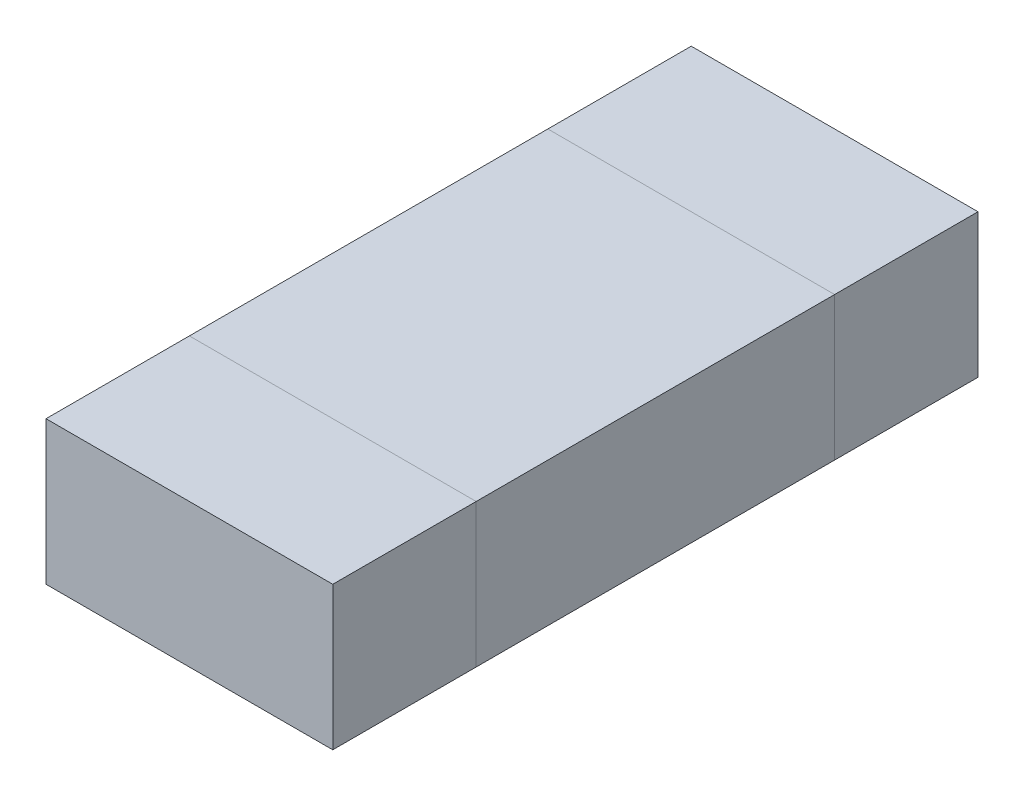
from build123d import *

# Parameters (mm, degrees)
MAINBODYS_W         = 0.8
MAINBODYS_H         = 1
MAINBODY_DEPTH      = 0.4
LEFTBODYS_W         = 0.8
LEFTBODYS_H         = 0.4
BOSS_EXTRUDE1_DEPTH = 0.4
RIGHTBODYS_W        = 0.8
RIGHTBODYS_H        = 0.4
BOSS_EXTRUDE2_DEPTH = 0.4


with BuildPart() as part:
    # MainBodyS → MainBody (new body)
    with BuildSketch(Plane(origin=(0, 0, 0), x_dir=(1, 0, 0), z_dir=(0, 1, 0))):
        Rectangle(MAINBODYS_W, MAINBODYS_H)
    extrude(amount=MAINBODY_DEPTH)


with BuildPart() as body_2:
    # LeftBodyS → Boss-Extrude1 (new body)
    with BuildSketch(Plane(origin=(0, 0, 0), x_dir=(-1, 0, 0), z_dir=(0, -1, 0))):
        with Locations((0, -0.7)):
            Rectangle(LEFTBODYS_W, LEFTBODYS_H)
    extrude(amount=-BOSS_EXTRUDE1_DEPTH)


with BuildPart() as body_3:
    # RightBodyS → Boss-Extrude2 (new body)
    with BuildSketch(Plane.XZ):
        with Locations((0, -0.7)):
            Rectangle(RIGHTBODYS_W, RIGHTBODYS_H)
    extrude(amount=-BOSS_EXTRUDE2_DEPTH)


solid = Compound([part.part, body_2.part, body_3.part])
